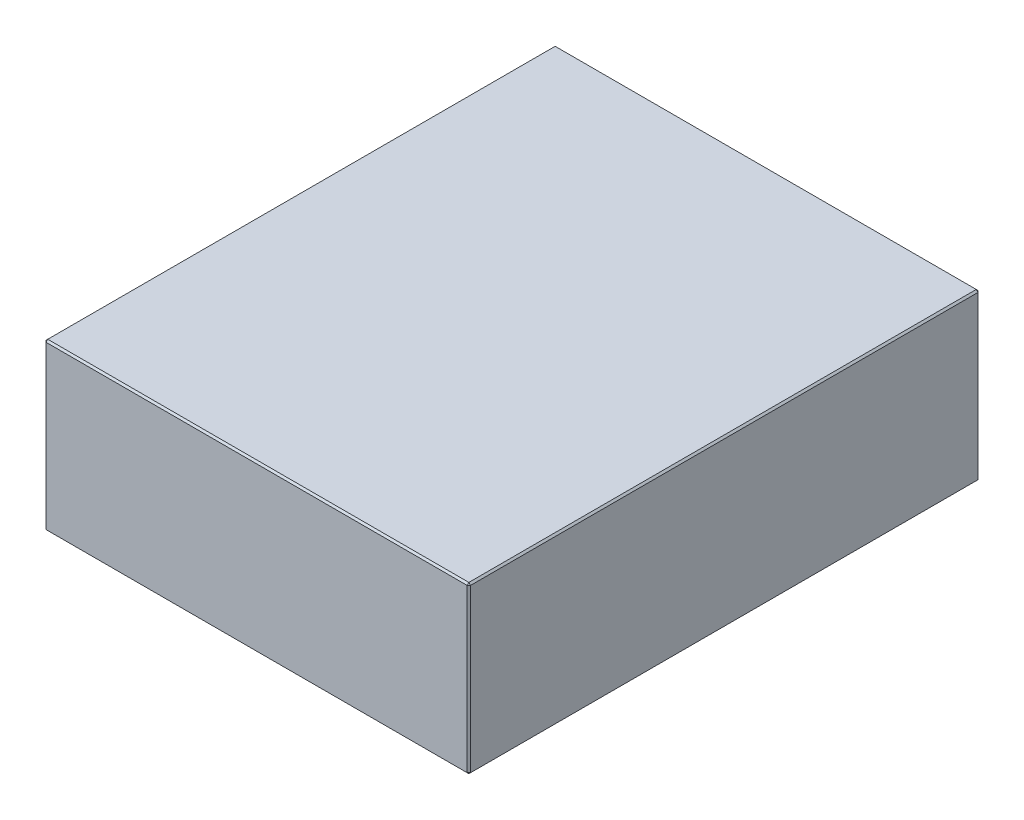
ISO-10303-21;
HEADER;
FILE_DESCRIPTION(('STEP AP214'),'2;1');
FILE_NAME('part.step','',(''),(''),'','','');
FILE_SCHEMA(('AUTOMOTIVE_DESIGN { 1 0 10303 214 1 1 1 1 }'));
ENDSEC;
DATA;
#1=APPLICATION_CONTEXT('core data for automotive mechanical design processes');
#2=APPLICATION_PROTOCOL_DEFINITION('international standard','automotive_design',2000,#1);
#3=PRODUCT_CONTEXT('',#1,'mechanical');
#4=PRODUCT('Part','Part','',(#3));
#5=PRODUCT_RELATED_PRODUCT_CATEGORY('part','',(#4));
#6=PRODUCT_DEFINITION_FORMATION('','',#4);
#7=PRODUCT_DEFINITION_CONTEXT('part definition',#1,'design');
#8=PRODUCT_DEFINITION('design','',#6,#7);
#9=PRODUCT_DEFINITION_SHAPE('','',#8);
#10=(LENGTH_UNIT() NAMED_UNIT(*) SI_UNIT(.MILLI.,.METRE.));
#11=(NAMED_UNIT(*) PLANE_ANGLE_UNIT() SI_UNIT($,.RADIAN.));
#12=(NAMED_UNIT(*) SI_UNIT($,.STERADIAN.) SOLID_ANGLE_UNIT());
#13=UNCERTAINTY_MEASURE_WITH_UNIT(LENGTH_MEASURE(1.E-05),#10,'distance_accuracy_value','');
#14=(GEOMETRIC_REPRESENTATION_CONTEXT(3) GLOBAL_UNCERTAINTY_ASSIGNED_CONTEXT((#13)) GLOBAL_UNIT_ASSIGNED_CONTEXT((#10,
#11,#12)) REPRESENTATION_CONTEXT('',''));
#15=CARTESIAN_POINT('',(0.,0.,0.));
#16=DIRECTION('',(0.,0.,1.));
#17=DIRECTION('',(1.,0.,0.));
#18=AXIS2_PLACEMENT_3D('',#15,#16,#17);
#19=CARTESIAN_POINT('',(-123.,96.,148.));
#20=DIRECTION('',(1.,0.,0.));
#21=DIRECTION('',(0.,0.,-1.));
#22=AXIS2_PLACEMENT_3D('',#19,#20,#21);
#23=PLANE('',#22);
#24=DIRECTION('',(0.,-1.,0.));
#25=VECTOR('',#24,1.);
#26=CARTESIAN_POINT('',(-123.,96.,-147.));
#27=LINE('',#26,#25);
#28=CARTESIAN_POINT('',(-123.,95.,-147.));
#29=VERTEX_POINT('',#28);
#30=CARTESIAN_POINT('',(-123.,0.999999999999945,-147.));
#31=VERTEX_POINT('',#30);
#32=EDGE_CURVE('E114',#29,#31,#27,.T.);
#33=ORIENTED_EDGE('',*,*,#32,.T.);
#34=DIRECTION('',(0.,0.,1.));
#35=VECTOR('',#34,1.);
#36=CARTESIAN_POINT('',(-123.,0.999999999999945,148.));
#37=LINE('',#36,#35);
#38=CARTESIAN_POINT('',(-123.,0.999999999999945,147.));
#39=VERTEX_POINT('',#38);
#40=EDGE_CURVE('E110',#31,#39,#37,.T.);
#41=ORIENTED_EDGE('',*,*,#40,.T.);
#42=DIRECTION('',(0.,1.,0.));
#43=VECTOR('',#42,1.);
#44=CARTESIAN_POINT('',(-123.,96.,147.));
#45=LINE('',#44,#43);
#46=CARTESIAN_POINT('',(-123.,95.,147.));
#47=VERTEX_POINT('',#46);
#48=EDGE_CURVE('E103',#39,#47,#45,.T.);
#49=ORIENTED_EDGE('',*,*,#48,.T.);
#50=DIRECTION('',(0.,0.,-1.));
#51=VECTOR('',#50,1.);
#52=CARTESIAN_POINT('',(-123.,95.,-148.));
#53=LINE('',#52,#51);
#54=EDGE_CURVE('E107',#47,#29,#53,.T.);
#55=ORIENTED_EDGE('',*,*,#54,.T.);
#56=EDGE_LOOP('',(#33,#41,#49,#55));
#57=FACE_BOUND('',#56,.T.);
#58=ADVANCED_FACE('F15',(#57),#23,.F.);
#59=CARTESIAN_POINT('',(123.,96.,148.));
#60=DIRECTION('',(0.,0.,-1.));
#61=DIRECTION('',(-1.,0.,0.));
#62=AXIS2_PLACEMENT_3D('',#59,#60,#61);
#63=PLANE('',#62);
#64=DIRECTION('',(-1.,0.,0.));
#65=VECTOR('',#64,1.);
#66=CARTESIAN_POINT('',(-123.,95.,148.));
#67=LINE('',#66,#65);
#68=CARTESIAN_POINT('',(122.,95.,148.));
#69=VERTEX_POINT('',#68);
#70=CARTESIAN_POINT('',(-122.,95.,148.));
#71=VERTEX_POINT('',#70);
#72=EDGE_CURVE('E164',#69,#71,#67,.T.);
#73=ORIENTED_EDGE('',*,*,#72,.T.);
#74=DIRECTION('',(0.,-1.,0.));
#75=VECTOR('',#74,1.);
#76=CARTESIAN_POINT('',(-122.,96.,148.));
#77=LINE('',#76,#75);
#78=CARTESIAN_POINT('',(-122.,0.999999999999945,148.));
#79=VERTEX_POINT('',#78);
#80=EDGE_CURVE('E122',#71,#79,#77,.T.);
#81=ORIENTED_EDGE('',*,*,#80,.T.);
#82=DIRECTION('',(1.,0.,0.));
#83=VECTOR('',#82,1.);
#84=CARTESIAN_POINT('',(123.,0.999999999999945,148.));
#85=LINE('',#84,#83);
#86=CARTESIAN_POINT('',(122.,0.999999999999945,148.));
#87=VERTEX_POINT('',#86);
#88=EDGE_CURVE('E168',#79,#87,#85,.T.);
#89=ORIENTED_EDGE('',*,*,#88,.T.);
#90=DIRECTION('',(0.,1.,0.));
#91=VECTOR('',#90,1.);
#92=CARTESIAN_POINT('',(122.,96.,148.));
#93=LINE('',#92,#91);
#94=EDGE_CURVE('E166',#87,#69,#93,.T.);
#95=ORIENTED_EDGE('',*,*,#94,.T.);
#96=EDGE_LOOP('',(#73,#81,#89,#95));
#97=FACE_BOUND('',#96,.T.);
#98=ADVANCED_FACE('F275',(#97),#63,.F.);
#99=CARTESIAN_POINT('',(123.,96.,148.));
#100=DIRECTION('',(-1.,0.,0.));
#101=DIRECTION('',(0.,0.,1.));
#102=AXIS2_PLACEMENT_3D('',#99,#100,#101);
#103=PLANE('',#102);
#104=DIRECTION('',(0.,0.,-1.));
#105=VECTOR('',#104,1.);
#106=CARTESIAN_POINT('',(123.,0.999999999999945,148.));
#107=LINE('',#106,#105);
#108=CARTESIAN_POINT('',(123.,0.999999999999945,147.));
#109=VERTEX_POINT('',#108);
#110=CARTESIAN_POINT('',(123.,0.999999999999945,-147.));
#111=VERTEX_POINT('',#110);
#112=EDGE_CURVE('E159',#109,#111,#107,.T.);
#113=ORIENTED_EDGE('',*,*,#112,.T.);
#114=DIRECTION('',(0.,1.,0.));
#115=VECTOR('',#114,1.);
#116=CARTESIAN_POINT('',(123.,96.,-147.));
#117=LINE('',#116,#115);
#118=CARTESIAN_POINT('',(123.,95.,-147.));
#119=VERTEX_POINT('',#118);
#120=EDGE_CURVE('E161',#111,#119,#117,.T.);
#121=ORIENTED_EDGE('',*,*,#120,.T.);
#122=DIRECTION('',(0.,0.,1.));
#123=VECTOR('',#122,1.);
#124=CARTESIAN_POINT('',(123.,95.,148.));
#125=LINE('',#124,#123);
#126=CARTESIAN_POINT('',(123.,95.,147.));
#127=VERTEX_POINT('',#126);
#128=EDGE_CURVE('E155',#119,#127,#125,.T.);
#129=ORIENTED_EDGE('',*,*,#128,.T.);
#130=DIRECTION('',(0.,-1.,0.));
#131=VECTOR('',#130,1.);
#132=CARTESIAN_POINT('',(123.,96.,147.));
#133=LINE('',#132,#131);
#134=EDGE_CURVE('E157',#127,#109,#133,.T.);
#135=ORIENTED_EDGE('',*,*,#134,.T.);
#136=EDGE_LOOP('',(#113,#121,#129,#135));
#137=FACE_BOUND('',#136,.T.);
#138=ADVANCED_FACE('F254',(#137),#103,.F.);
#139=CARTESIAN_POINT('',(123.,96.,-148.));
#140=DIRECTION('',(0.,0.,1.));
#141=DIRECTION('',(1.,0.,0.));
#142=AXIS2_PLACEMENT_3D('',#139,#140,#141);
#143=PLANE('',#142);
#144=DIRECTION('',(0.,-1.,0.));
#145=VECTOR('',#144,1.);
#146=CARTESIAN_POINT('',(122.,96.,-148.));
#147=LINE('',#146,#145);
#148=CARTESIAN_POINT('',(122.,95.,-148.));
#149=VERTEX_POINT('',#148);
#150=CARTESIAN_POINT('',(122.,0.999999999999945,-148.));
#151=VERTEX_POINT('',#150);
#152=EDGE_CURVE('E148',#149,#151,#147,.T.);
#153=ORIENTED_EDGE('',*,*,#152,.T.);
#154=DIRECTION('',(-1.,0.,0.));
#155=VECTOR('',#154,1.);
#156=CARTESIAN_POINT('',(123.,0.999999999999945,-148.));
#157=LINE('',#156,#155);
#158=CARTESIAN_POINT('',(-122.,0.999999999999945,-148.));
#159=VERTEX_POINT('',#158);
#160=EDGE_CURVE('E153',#151,#159,#157,.T.);
#161=ORIENTED_EDGE('',*,*,#160,.T.);
#162=DIRECTION('',(0.,1.,0.));
#163=VECTOR('',#162,1.);
#164=CARTESIAN_POINT('',(-122.,96.,-148.));
#165=LINE('',#164,#163);
#166=CARTESIAN_POINT('',(-122.,95.,-148.));
#167=VERTEX_POINT('',#166);
#168=EDGE_CURVE('E150',#159,#167,#165,.T.);
#169=ORIENTED_EDGE('',*,*,#168,.T.);
#170=DIRECTION('',(1.,0.,0.));
#171=VECTOR('',#170,1.);
#172=CARTESIAN_POINT('',(123.,95.,-148.));
#173=LINE('',#172,#171);
#174=EDGE_CURVE('E146',#167,#149,#173,.T.);
#175=ORIENTED_EDGE('',*,*,#174,.T.);
#176=EDGE_LOOP('',(#153,#161,#169,#175));
#177=FACE_BOUND('',#176,.T.);
#178=ADVANCED_FACE('F284',(#177),#143,.F.);
#179=CARTESIAN_POINT('',(0.,96.,0.));
#180=DIRECTION('',(0.,1.,0.));
#181=DIRECTION('',(0.,0.,1.));
#182=AXIS2_PLACEMENT_3D('',#179,#180,#181);
#183=PLANE('',#182);
#184=DIRECTION('',(0.,0.,-1.));
#185=VECTOR('',#184,1.);
#186=CARTESIAN_POINT('',(122.,96.,-148.));
#187=LINE('',#186,#185);
#188=CARTESIAN_POINT('',(122.,96.,147.));
#189=VERTEX_POINT('',#188);
#190=CARTESIAN_POINT('',(122.,96.,-147.));
#191=VERTEX_POINT('',#190);
#192=EDGE_CURVE('E24',#189,#191,#187,.T.);
#193=ORIENTED_EDGE('',*,*,#192,.T.);
#194=DIRECTION('',(-1.,0.,0.));
#195=VECTOR('',#194,1.);
#196=CARTESIAN_POINT('',(-123.,96.,-147.));
#197=LINE('',#196,#195);
#198=CARTESIAN_POINT('',(-122.,96.,-147.));
#199=VERTEX_POINT('',#198);
#200=EDGE_CURVE('E9',#191,#199,#197,.T.);
#201=ORIENTED_EDGE('',*,*,#200,.T.);
#202=DIRECTION('',(0.,0.,1.));
#203=VECTOR('',#202,1.);
#204=CARTESIAN_POINT('',(-122.,96.,148.));
#205=LINE('',#204,#203);
#206=CARTESIAN_POINT('',(-122.,96.,147.));
#207=VERTEX_POINT('',#206);
#208=EDGE_CURVE('E180',#199,#207,#205,.T.);
#209=ORIENTED_EDGE('',*,*,#208,.T.);
#210=DIRECTION('',(1.,0.,0.));
#211=VECTOR('',#210,1.);
#212=CARTESIAN_POINT('',(123.,96.,147.));
#213=LINE('',#212,#211);
#214=EDGE_CURVE('E35',#207,#189,#213,.T.);
#215=ORIENTED_EDGE('',*,*,#214,.T.);
#216=EDGE_LOOP('',(#193,#201,#209,#215));
#217=FACE_BOUND('',#216,.T.);
#218=ADVANCED_FACE('F350',(#217),#183,.T.);
#219=CARTESIAN_POINT('',(0.,0.,0.));
#220=DIRECTION('',(0.,1.,0.));
#221=DIRECTION('',(0.,0.,1.));
#222=AXIS2_PLACEMENT_3D('',#219,#220,#221);
#223=PLANE('',#222);
#224=DIRECTION('',(0.,0.,1.));
#225=VECTOR('',#224,1.);
#226=CARTESIAN_POINT('',(122.,0.,0.));
#227=LINE('',#226,#225);
#228=CARTESIAN_POINT('',(122.,0.,-147.));
#229=VERTEX_POINT('',#228);
#230=CARTESIAN_POINT('',(122.,0.,147.));
#231=VERTEX_POINT('',#230);
#232=EDGE_CURVE('E171',#229,#231,#227,.T.);
#233=ORIENTED_EDGE('',*,*,#232,.T.);
#234=DIRECTION('',(-1.,0.,0.));
#235=VECTOR('',#234,1.);
#236=CARTESIAN_POINT('',(0.,0.,147.));
#237=LINE('',#236,#235);
#238=CARTESIAN_POINT('',(-122.,0.,147.));
#239=VERTEX_POINT('',#238);
#240=EDGE_CURVE('E177',#231,#239,#237,.T.);
#241=ORIENTED_EDGE('',*,*,#240,.T.);
#242=DIRECTION('',(0.,0.,-1.));
#243=VECTOR('',#242,1.);
#244=CARTESIAN_POINT('',(-122.,0.,0.));
#245=LINE('',#244,#243);
#246=CARTESIAN_POINT('',(-122.,0.,-147.));
#247=VERTEX_POINT('',#246);
#248=EDGE_CURVE('E175',#239,#247,#245,.T.);
#249=ORIENTED_EDGE('',*,*,#248,.T.);
#250=DIRECTION('',(1.,0.,0.));
#251=VECTOR('',#250,1.);
#252=CARTESIAN_POINT('',(0.,0.,-147.));
#253=LINE('',#252,#251);
#254=EDGE_CURVE('E173',#247,#229,#253,.T.);
#255=ORIENTED_EDGE('',*,*,#254,.T.);
#256=EDGE_LOOP('',(#233,#241,#249,#255));
#257=FACE_BOUND('',#256,.T.);
#258=ADVANCED_FACE('F246',(#257),#223,.F.);
#259=CARTESIAN_POINT('',(123.,96.,147.));
#260=DIRECTION('',(-0.707106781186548,0.,-0.707106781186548));
#261=DIRECTION('',(0.,-1.,0.));
#262=AXIS2_PLACEMENT_3D('',#259,#260,#261);
#263=PLANE('',#262);
#264=DIRECTION('',(-0.707106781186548,0.,0.707106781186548));
#265=VECTOR('',#264,1.);
#266=CARTESIAN_POINT('',(122.,95.,148.));
#267=LINE('',#266,#265);
#268=EDGE_CURVE('E19',#69,#127,#267,.F.);
#269=ORIENTED_EDGE('',*,*,#268,.F.);
#270=ORIENTED_EDGE('',*,*,#94,.F.);
#271=DIRECTION('',(0.707106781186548,0.,-0.707106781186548));
#272=VECTOR('',#271,1.);
#273=CARTESIAN_POINT('',(122.,0.999999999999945,148.));
#274=LINE('',#273,#272);
#275=EDGE_CURVE('E142',#109,#87,#274,.F.);
#276=ORIENTED_EDGE('',*,*,#275,.F.);
#277=ORIENTED_EDGE('',*,*,#134,.F.);
#278=EDGE_LOOP('',(#269,#270,#276,#277));
#279=FACE_BOUND('',#278,.T.);
#280=ADVANCED_FACE('F17',(#279),#263,.F.);
#281=CARTESIAN_POINT('',(122.,95.,148.));
#282=DIRECTION('',(0.577350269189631,0.577350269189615,0.577350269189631));
#283=DIRECTION('',(0.707106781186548,0.,-0.707106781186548));
#284=AXIS2_PLACEMENT_3D('',#281,#282,#283);
#285=PLANE('',#284);
#286=DIRECTION('',(0.,-0.707106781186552,0.707106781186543));
#287=VECTOR('',#286,1.);
#288=CARTESIAN_POINT('',(122.,95.,148.));
#289=LINE('',#288,#287);
#290=EDGE_CURVE('E226',#69,#189,#289,.F.);
#291=ORIENTED_EDGE('',*,*,#290,.F.);
#292=ORIENTED_EDGE('',*,*,#268,.T.);
#293=DIRECTION('',(-0.707106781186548,0.707106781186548,0.));
#294=VECTOR('',#293,1.);
#295=CARTESIAN_POINT('',(122.5,95.5,147.));
#296=LINE('',#295,#294);
#297=EDGE_CURVE('E228',#189,#127,#296,.F.);
#298=ORIENTED_EDGE('',*,*,#297,.F.);
#299=EDGE_LOOP('',(#291,#292,#298));
#300=FACE_BOUND('',#299,.T.);
#301=ADVANCED_FACE('F270',(#300),#285,.T.);
#302=CARTESIAN_POINT('',(122.,0.999999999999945,148.));
#303=DIRECTION('',(0.577350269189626,-0.577350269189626,0.577350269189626));
#304=DIRECTION('',(0.707106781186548,0.,-0.707106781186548));
#305=AXIS2_PLACEMENT_3D('',#302,#303,#304);
#306=PLANE('',#305);
#307=DIRECTION('',(-0.707106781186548,-0.707106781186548,0.));
#308=VECTOR('',#307,1.);
#309=CARTESIAN_POINT('',(122.5,0.499999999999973,147.));
#310=LINE('',#309,#308);
#311=EDGE_CURVE('E220',#109,#231,#310,.T.);
#312=ORIENTED_EDGE('',*,*,#311,.F.);
#313=ORIENTED_EDGE('',*,*,#275,.T.);
#314=DIRECTION('',(0.,0.707106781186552,0.707106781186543));
#315=VECTOR('',#314,1.);
#316=CARTESIAN_POINT('',(122.,0.999999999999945,148.));
#317=LINE('',#316,#315);
#318=EDGE_CURVE('E223',#231,#87,#317,.T.);
#319=ORIENTED_EDGE('',*,*,#318,.F.);
#320=EDGE_LOOP('',(#312,#313,#319));
#321=FACE_BOUND('',#320,.T.);
#322=ADVANCED_FACE('F235',(#321),#306,.T.);
#323=CARTESIAN_POINT('',(122.,96.,0.));
#324=DIRECTION('',(0.707106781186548,0.707106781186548,0.));
#325=DIRECTION('',(0.,0.,1.));
#326=AXIS2_PLACEMENT_3D('',#323,#324,#325);
#327=PLANE('',#326);
#328=ORIENTED_EDGE('',*,*,#297,.T.);
#329=ORIENTED_EDGE('',*,*,#128,.F.);
#330=DIRECTION('',(0.707106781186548,-0.707106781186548,0.));
#331=VECTOR('',#330,1.);
#332=CARTESIAN_POINT('',(123.,95.,-147.));
#333=LINE('',#332,#331);
#334=EDGE_CURVE('E215',#191,#119,#333,.T.);
#335=ORIENTED_EDGE('',*,*,#334,.F.);
#336=ORIENTED_EDGE('',*,*,#192,.F.);
#337=EDGE_LOOP('',(#328,#329,#335,#336));
#338=FACE_BOUND('',#337,.T.);
#339=ADVANCED_FACE('F265',(#338),#327,.T.);
#340=CARTESIAN_POINT('',(0.,96.,147.));
#341=DIRECTION('',(0.,0.707106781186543,0.707106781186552));
#342=DIRECTION('',(-1.,0.,0.));
#343=AXIS2_PLACEMENT_3D('',#340,#341,#342);
#344=PLANE('',#343);
#345=ORIENTED_EDGE('',*,*,#290,.T.);
#346=ORIENTED_EDGE('',*,*,#214,.F.);
#347=DIRECTION('',(0.,0.707106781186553,-0.707106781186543));
#348=VECTOR('',#347,1.);
#349=CARTESIAN_POINT('',(-122.,95.5,147.5));
#350=LINE('',#349,#348);
#351=EDGE_CURVE('E126',#71,#207,#350,.T.);
#352=ORIENTED_EDGE('',*,*,#351,.F.);
#353=ORIENTED_EDGE('',*,*,#72,.F.);
#354=EDGE_LOOP('',(#345,#346,#352,#353));
#355=FACE_BOUND('',#354,.T.);
#356=ADVANCED_FACE('F273',(#355),#344,.T.);
#357=CARTESIAN_POINT('',(-122.,96.,148.));
#358=DIRECTION('',(0.707106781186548,0.,-0.707106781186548));
#359=DIRECTION('',(0.,-1.,0.));
#360=AXIS2_PLACEMENT_3D('',#357,#358,#359);
#361=PLANE('',#360);
#362=DIRECTION('',(0.707106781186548,0.,0.707106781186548));
#363=VECTOR('',#362,1.);
#364=CARTESIAN_POINT('',(-122.,0.999999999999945,148.));
#365=LINE('',#364,#363);
#366=EDGE_CURVE('E127',#79,#39,#365,.F.);
#367=ORIENTED_EDGE('',*,*,#366,.F.);
#368=ORIENTED_EDGE('',*,*,#80,.F.);
#369=DIRECTION('',(-0.707106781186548,0.,-0.707106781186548));
#370=VECTOR('',#369,1.);
#371=CARTESIAN_POINT('',(-123.,95.,147.));
#372=LINE('',#371,#370);
#373=EDGE_CURVE('E118',#47,#71,#372,.F.);
#374=ORIENTED_EDGE('',*,*,#373,.F.);
#375=ORIENTED_EDGE('',*,*,#48,.F.);
#376=EDGE_LOOP('',(#367,#368,#374,#375));
#377=FACE_BOUND('',#376,.T.);
#378=ADVANCED_FACE('F120',(#377),#361,.F.);
#379=CARTESIAN_POINT('',(123.,0.999999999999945,148.));
#380=DIRECTION('',(0.,0.707106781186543,-0.707106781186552));
#381=DIRECTION('',(1.,0.,0.));
#382=AXIS2_PLACEMENT_3D('',#379,#380,#381);
#383=PLANE('',#382);
#384=ORIENTED_EDGE('',*,*,#318,.T.);
#385=ORIENTED_EDGE('',*,*,#88,.F.);
#386=DIRECTION('',(0.,-0.707106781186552,-0.707106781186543));
#387=VECTOR('',#386,1.);
#388=CARTESIAN_POINT('',(-122.,0.999999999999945,148.));
#389=LINE('',#388,#387);
#390=EDGE_CURVE('E211',#239,#79,#389,.F.);
#391=ORIENTED_EDGE('',*,*,#390,.F.);
#392=ORIENTED_EDGE('',*,*,#240,.F.);
#393=EDGE_LOOP('',(#384,#385,#391,#392));
#394=FACE_BOUND('',#393,.T.);
#395=ADVANCED_FACE('F243',(#394),#383,.F.);
#396=CARTESIAN_POINT('',(123.,0.999999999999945,148.));
#397=DIRECTION('',(-0.707106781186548,0.707106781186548,0.));
#398=DIRECTION('',(0.,0.,-1.));
#399=AXIS2_PLACEMENT_3D('',#396,#397,#398);
#400=PLANE('',#399);
#401=ORIENTED_EDGE('',*,*,#311,.T.);
#402=ORIENTED_EDGE('',*,*,#232,.F.);
#403=DIRECTION('',(0.707106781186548,0.707106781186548,0.));
#404=VECTOR('',#403,1.);
#405=CARTESIAN_POINT('',(122.5,0.499999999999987,-147.));
#406=LINE('',#405,#404);
#407=EDGE_CURVE('E208',#111,#229,#406,.F.);
#408=ORIENTED_EDGE('',*,*,#407,.F.);
#409=ORIENTED_EDGE('',*,*,#112,.F.);
#410=EDGE_LOOP('',(#401,#402,#408,#409));
#411=FACE_BOUND('',#410,.T.);
#412=ADVANCED_FACE('F251',(#411),#400,.F.);
#413=CARTESIAN_POINT('',(122.,96.,-148.));
#414=DIRECTION('',(-0.707106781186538,0.,0.707106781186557));
#415=DIRECTION('',(0.,-1.,0.));
#416=AXIS2_PLACEMENT_3D('',#413,#414,#415);
#417=PLANE('',#416);
#418=DIRECTION('',(0.707106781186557,0.,0.707106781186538));
#419=VECTOR('',#418,1.);
#420=CARTESIAN_POINT('',(123.,95.,-147.));
#421=LINE('',#420,#419);
#422=EDGE_CURVE('E217',#119,#149,#421,.F.);
#423=ORIENTED_EDGE('',*,*,#422,.F.);
#424=ORIENTED_EDGE('',*,*,#120,.F.);
#425=DIRECTION('',(-0.707106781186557,0.,-0.707106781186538));
#426=VECTOR('',#425,1.);
#427=CARTESIAN_POINT('',(122.,0.999999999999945,-148.));
#428=LINE('',#427,#426);
#429=EDGE_CURVE('E205',#151,#111,#428,.F.);
#430=ORIENTED_EDGE('',*,*,#429,.F.);
#431=ORIENTED_EDGE('',*,*,#152,.F.);
#432=EDGE_LOOP('',(#423,#424,#430,#431));
#433=FACE_BOUND('',#432,.T.);
#434=ADVANCED_FACE('F258',(#433),#417,.F.);
#435=CARTESIAN_POINT('',(123.,95.,-147.));
#436=DIRECTION('',(0.577350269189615,0.577350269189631,-0.577350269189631));
#437=DIRECTION('',(0.,0.707106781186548,0.707106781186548));
#438=AXIS2_PLACEMENT_3D('',#435,#436,#437);
#439=PLANE('',#438);
#440=ORIENTED_EDGE('',*,*,#334,.T.);
#441=ORIENTED_EDGE('',*,*,#422,.T.);
#442=DIRECTION('',(0.,0.707106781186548,0.707106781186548));
#443=VECTOR('',#442,1.);
#444=CARTESIAN_POINT('',(122.,95.5,-147.5));
#445=LINE('',#444,#443);
#446=EDGE_CURVE('E134',#191,#149,#445,.F.);
#447=ORIENTED_EDGE('',*,*,#446,.F.);
#448=EDGE_LOOP('',(#440,#441,#447));
#449=FACE_BOUND('',#448,.T.);
#450=ADVANCED_FACE('F325',(#449),#439,.T.);
#451=CARTESIAN_POINT('',(-123.,95.,147.));
#452=DIRECTION('',(-0.577350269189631,0.577350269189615,0.577350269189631));
#453=DIRECTION('',(0.707106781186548,0.,0.707106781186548));
#454=AXIS2_PLACEMENT_3D('',#451,#452,#453);
#455=PLANE('',#454);
#456=ORIENTED_EDGE('',*,*,#373,.T.);
#457=ORIENTED_EDGE('',*,*,#351,.T.);
#458=DIRECTION('',(-0.707106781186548,-0.707106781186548,0.));
#459=VECTOR('',#458,1.);
#460=CARTESIAN_POINT('',(-123.,95.,147.));
#461=LINE('',#460,#459);
#462=EDGE_CURVE('E130',#47,#207,#461,.F.);
#463=ORIENTED_EDGE('',*,*,#462,.F.);
#464=EDGE_LOOP('',(#456,#457,#463));
#465=FACE_BOUND('',#464,.T.);
#466=ADVANCED_FACE('F131',(#465),#455,.T.);
#467=CARTESIAN_POINT('',(-122.,0.999999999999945,148.));
#468=DIRECTION('',(-0.577350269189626,-0.577350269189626,0.577350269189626));
#469=DIRECTION('',(0.707106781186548,0.,0.707106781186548));
#470=AXIS2_PLACEMENT_3D('',#467,#468,#469);
#471=PLANE('',#470);
#472=ORIENTED_EDGE('',*,*,#390,.T.);
#473=ORIENTED_EDGE('',*,*,#366,.T.);
#474=DIRECTION('',(-0.707106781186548,0.707106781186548,0.));
#475=VECTOR('',#474,1.);
#476=CARTESIAN_POINT('',(-122.5,0.499999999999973,147.));
#477=LINE('',#476,#475);
#478=EDGE_CURVE('E135',#239,#39,#477,.T.);
#479=ORIENTED_EDGE('',*,*,#478,.F.);
#480=EDGE_LOOP('',(#472,#473,#479));
#481=FACE_BOUND('',#480,.T.);
#482=ADVANCED_FACE('F318',(#481),#471,.T.);
#483=CARTESIAN_POINT('',(122.,0.999999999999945,-148.));
#484=DIRECTION('',(0.577350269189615,-0.577350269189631,-0.577350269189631));
#485=DIRECTION('',(0.,0.707106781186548,-0.707106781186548));
#486=AXIS2_PLACEMENT_3D('',#483,#484,#485);
#487=PLANE('',#486);
#488=ORIENTED_EDGE('',*,*,#429,.T.);
#489=ORIENTED_EDGE('',*,*,#407,.T.);
#490=DIRECTION('',(0.,-0.707106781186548,0.707106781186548));
#491=VECTOR('',#490,1.);
#492=CARTESIAN_POINT('',(122.,0.999999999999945,-148.));
#493=LINE('',#492,#491);
#494=EDGE_CURVE('E198',#151,#229,#493,.T.);
#495=ORIENTED_EDGE('',*,*,#494,.F.);
#496=EDGE_LOOP('',(#488,#489,#495));
#497=FACE_BOUND('',#496,.T.);
#498=ADVANCED_FACE('F314',(#497),#487,.T.);
#499=CARTESIAN_POINT('',(0.,96.,-147.));
#500=DIRECTION('',(0.,0.707106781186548,-0.707106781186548));
#501=DIRECTION('',(1.,0.,0.));
#502=AXIS2_PLACEMENT_3D('',#499,#500,#501);
#503=PLANE('',#502);
#504=ORIENTED_EDGE('',*,*,#446,.T.);
#505=ORIENTED_EDGE('',*,*,#174,.F.);
#506=DIRECTION('',(0.,-0.707106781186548,-0.707106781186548));
#507=VECTOR('',#506,1.);
#508=CARTESIAN_POINT('',(-122.,95.,-148.));
#509=LINE('',#508,#507);
#510=EDGE_CURVE('E195',#199,#167,#509,.T.);
#511=ORIENTED_EDGE('',*,*,#510,.F.);
#512=ORIENTED_EDGE('',*,*,#200,.F.);
#513=EDGE_LOOP('',(#504,#505,#511,#512));
#514=FACE_BOUND('',#513,.T.);
#515=ADVANCED_FACE('F311',(#514),#503,.T.);
#516=CARTESIAN_POINT('',(-122.,96.,0.));
#517=DIRECTION('',(-0.707106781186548,0.707106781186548,0.));
#518=DIRECTION('',(0.,0.,-1.));
#519=AXIS2_PLACEMENT_3D('',#516,#517,#518);
#520=PLANE('',#519);
#521=ORIENTED_EDGE('',*,*,#462,.T.);
#522=ORIENTED_EDGE('',*,*,#208,.F.);
#523=DIRECTION('',(0.707106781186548,0.707106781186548,0.));
#524=VECTOR('',#523,1.);
#525=CARTESIAN_POINT('',(-122.5,95.5,-147.));
#526=LINE('',#525,#524);
#527=EDGE_CURVE('E138',#29,#199,#526,.T.);
#528=ORIENTED_EDGE('',*,*,#527,.F.);
#529=ORIENTED_EDGE('',*,*,#54,.F.);
#530=EDGE_LOOP('',(#521,#522,#528,#529));
#531=FACE_BOUND('',#530,.T.);
#532=ADVANCED_FACE('F137',(#531),#520,.T.);
#533=CARTESIAN_POINT('',(-123.,0.999999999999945,148.));
#534=DIRECTION('',(0.707106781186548,0.707106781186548,0.));
#535=DIRECTION('',(0.,0.,1.));
#536=AXIS2_PLACEMENT_3D('',#533,#534,#535);
#537=PLANE('',#536);
#538=ORIENTED_EDGE('',*,*,#478,.T.);
#539=ORIENTED_EDGE('',*,*,#40,.F.);
#540=DIRECTION('',(0.707106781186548,-0.707106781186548,0.));
#541=VECTOR('',#540,1.);
#542=CARTESIAN_POINT('',(-123.,0.999999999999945,-147.));
#543=LINE('',#542,#541);
#544=EDGE_CURVE('E191',#247,#31,#543,.F.);
#545=ORIENTED_EDGE('',*,*,#544,.F.);
#546=ORIENTED_EDGE('',*,*,#248,.F.);
#547=EDGE_LOOP('',(#538,#539,#545,#546));
#548=FACE_BOUND('',#547,.T.);
#549=ADVANCED_FACE('F304',(#548),#537,.F.);
#550=CARTESIAN_POINT('',(123.,0.999999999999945,-148.));
#551=DIRECTION('',(0.,0.707106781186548,0.707106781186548));
#552=DIRECTION('',(-1.,0.,0.));
#553=AXIS2_PLACEMENT_3D('',#550,#551,#552);
#554=PLANE('',#553);
#555=ORIENTED_EDGE('',*,*,#494,.T.);
#556=ORIENTED_EDGE('',*,*,#254,.F.);
#557=DIRECTION('',(0.,0.707106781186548,-0.707106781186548));
#558=VECTOR('',#557,1.);
#559=CARTESIAN_POINT('',(-122.,0.499999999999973,-147.5));
#560=LINE('',#559,#558);
#561=EDGE_CURVE('E188',#159,#247,#560,.F.);
#562=ORIENTED_EDGE('',*,*,#561,.F.);
#563=ORIENTED_EDGE('',*,*,#160,.F.);
#564=EDGE_LOOP('',(#555,#556,#562,#563));
#565=FACE_BOUND('',#564,.T.);
#566=ADVANCED_FACE('F300',(#565),#554,.F.);
#567=CARTESIAN_POINT('',(-122.,95.,-148.));
#568=DIRECTION('',(-0.577350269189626,0.577350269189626,-0.577350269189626));
#569=DIRECTION('',(-0.707106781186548,0.,0.707106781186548));
#570=AXIS2_PLACEMENT_3D('',#567,#568,#569);
#571=PLANE('',#570);
#572=ORIENTED_EDGE('',*,*,#527,.T.);
#573=ORIENTED_EDGE('',*,*,#510,.T.);
#574=DIRECTION('',(0.707106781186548,0.,-0.707106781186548));
#575=VECTOR('',#574,1.);
#576=CARTESIAN_POINT('',(-122.,95.,-148.));
#577=LINE('',#576,#575);
#578=EDGE_CURVE('E186',#29,#167,#577,.T.);
#579=ORIENTED_EDGE('',*,*,#578,.F.);
#580=EDGE_LOOP('',(#572,#573,#579));
#581=FACE_BOUND('',#580,.T.);
#582=ADVANCED_FACE('F296',(#581),#571,.T.);
#583=CARTESIAN_POINT('',(-123.,0.999999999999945,-147.));
#584=DIRECTION('',(-0.577350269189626,-0.577350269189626,-0.577350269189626));
#585=DIRECTION('',(-0.707106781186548,0.,0.707106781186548));
#586=AXIS2_PLACEMENT_3D('',#583,#584,#585);
#587=PLANE('',#586);
#588=ORIENTED_EDGE('',*,*,#561,.T.);
#589=ORIENTED_EDGE('',*,*,#544,.T.);
#590=DIRECTION('',(-0.707106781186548,0.,0.707106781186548));
#591=VECTOR('',#590,1.);
#592=CARTESIAN_POINT('',(-123.,0.999999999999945,-147.));
#593=LINE('',#592,#591);
#594=EDGE_CURVE('E184',#159,#31,#593,.T.);
#595=ORIENTED_EDGE('',*,*,#594,.F.);
#596=EDGE_LOOP('',(#588,#589,#595));
#597=FACE_BOUND('',#596,.T.);
#598=ADVANCED_FACE('F292',(#597),#587,.T.);
#599=CARTESIAN_POINT('',(-123.,96.,-147.));
#600=DIRECTION('',(0.707106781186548,0.,0.707106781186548));
#601=DIRECTION('',(0.,-1.,0.));
#602=AXIS2_PLACEMENT_3D('',#599,#600,#601);
#603=PLANE('',#602);
#604=ORIENTED_EDGE('',*,*,#578,.T.);
#605=ORIENTED_EDGE('',*,*,#168,.F.);
#606=ORIENTED_EDGE('',*,*,#594,.T.);
#607=ORIENTED_EDGE('',*,*,#32,.F.);
#608=EDGE_LOOP('',(#604,#605,#606,#607));
#609=FACE_BOUND('',#608,.T.);
#610=ADVANCED_FACE('F289',(#609),#603,.F.);
#611=CLOSED_SHELL('',(#58,#98,#138,#178,#218,#258,#280,#301,#322,#339,#356,#378,#395,#412,#434,
#450,#466,#482,#498,#515,#532,#549,#566,#582,#598,#610));
#612=MANIFOLD_SOLID_BREP('B1',#611);
#613=ADVANCED_BREP_SHAPE_REPRESENTATION('',(#18,#612),#14);
#614=SHAPE_DEFINITION_REPRESENTATION(#9,#613);
ENDSEC;
END-ISO-10303-21;
